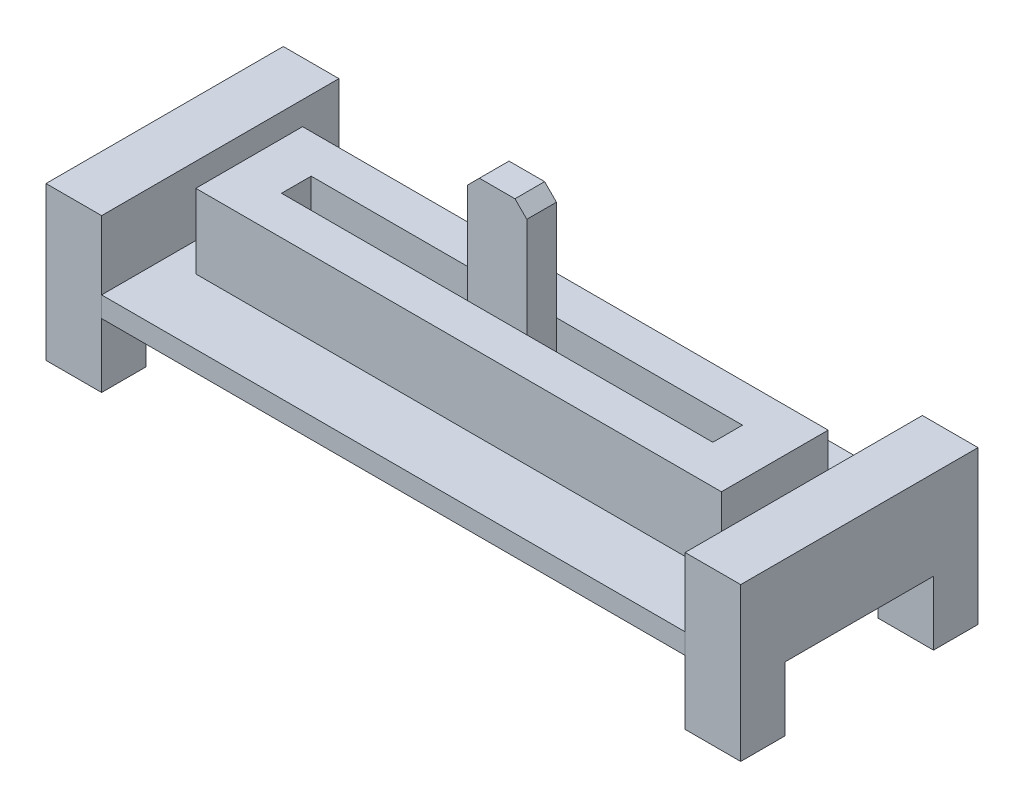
ISO-10303-21;
HEADER;
FILE_DESCRIPTION(('STEP AP214'),'2;1');
FILE_NAME('part.step','',(''),(''),'','','');
FILE_SCHEMA(('AUTOMOTIVE_DESIGN { 1 0 10303 214 1 1 1 1 }'));
ENDSEC;
DATA;
#1=APPLICATION_CONTEXT('core data for automotive mechanical design processes');
#2=APPLICATION_PROTOCOL_DEFINITION('international standard','automotive_design',2000,#1);
#3=PRODUCT_CONTEXT('',#1,'mechanical');
#4=PRODUCT('Part','Part','',(#3));
#5=PRODUCT_RELATED_PRODUCT_CATEGORY('part','',(#4));
#6=PRODUCT_DEFINITION_FORMATION('','',#4);
#7=PRODUCT_DEFINITION_CONTEXT('part definition',#1,'design');
#8=PRODUCT_DEFINITION('design','',#6,#7);
#9=PRODUCT_DEFINITION_SHAPE('','',#8);
#10=(LENGTH_UNIT() NAMED_UNIT(*) SI_UNIT(.MILLI.,.METRE.));
#11=(NAMED_UNIT(*) PLANE_ANGLE_UNIT() SI_UNIT($,.RADIAN.));
#12=(NAMED_UNIT(*) SI_UNIT($,.STERADIAN.) SOLID_ANGLE_UNIT());
#13=UNCERTAINTY_MEASURE_WITH_UNIT(LENGTH_MEASURE(1.E-05),#10,'distance_accuracy_value','');
#14=(GEOMETRIC_REPRESENTATION_CONTEXT(3) GLOBAL_UNCERTAINTY_ASSIGNED_CONTEXT((#13)) GLOBAL_UNIT_ASSIGNED_CONTEXT((#10,
#11,#12)) REPRESENTATION_CONTEXT('',''));
#15=CARTESIAN_POINT('',(0.,0.,0.));
#16=DIRECTION('',(0.,0.,1.));
#17=DIRECTION('',(1.,0.,0.));
#18=AXIS2_PLACEMENT_3D('',#15,#16,#17);
#19=CARTESIAN_POINT('',(29.7434,5.8801,-10.16));
#20=DIRECTION('',(0.,-1.,0.));
#21=DIRECTION('',(0.,0.,-1.));
#22=AXIS2_PLACEMENT_3D('',#19,#20,#21);
#23=PLANE('',#22);
#24=DIRECTION('',(0.,0.,1.));
#25=VECTOR('',#24,1.);
#26=CARTESIAN_POINT('',(24.9809,5.8801,-10.16));
#27=LINE('',#26,#25);
#28=CARTESIAN_POINT('',(24.9809,5.8801,-10.16));
#29=VERTEX_POINT('',#28);
#30=CARTESIAN_POINT('',(24.9809,5.8801,10.16));
#31=VERTEX_POINT('',#30);
#32=EDGE_CURVE('E139',#29,#31,#27,.T.);
#33=ORIENTED_EDGE('',*,*,#32,.T.);
#34=DIRECTION('',(-1.,0.,0.));
#35=VECTOR('',#34,1.);
#36=CARTESIAN_POINT('',(29.7434,5.8801,10.16));
#37=LINE('',#36,#35);
#38=CARTESIAN_POINT('',(29.7434,5.8801,10.16));
#39=VERTEX_POINT('',#38);
#40=EDGE_CURVE('E12',#39,#31,#37,.T.);
#41=ORIENTED_EDGE('',*,*,#40,.F.);
#42=DIRECTION('',(0.,0.,1.));
#43=VECTOR('',#42,1.);
#44=CARTESIAN_POINT('',(29.7434,5.8801,-10.16));
#45=LINE('',#44,#43);
#46=CARTESIAN_POINT('',(29.7434,5.8801,-10.16));
#47=VERTEX_POINT('',#46);
#48=EDGE_CURVE('E153',#47,#39,#45,.T.);
#49=ORIENTED_EDGE('',*,*,#48,.F.);
#50=DIRECTION('',(-1.,0.,0.));
#51=VECTOR('',#50,1.);
#52=CARTESIAN_POINT('',(29.7434,5.8801,-10.16));
#53=LINE('',#52,#51);
#54=EDGE_CURVE('E135',#47,#29,#53,.T.);
#55=ORIENTED_EDGE('',*,*,#54,.T.);
#56=EDGE_LOOP('',(#33,#41,#49,#55));
#57=FACE_BOUND('',#56,.T.);
#58=ADVANCED_FACE('F43',(#57),#23,.F.);
#59=CARTESIAN_POINT('',(29.7434,5.8801,10.16));
#60=DIRECTION('',(0.,0.,-1.));
#61=DIRECTION('',(0.,1.,0.));
#62=AXIS2_PLACEMENT_3D('',#59,#60,#61);
#63=PLANE('',#62);
#64=DIRECTION('',(0.,-1.,0.));
#65=VECTOR('',#64,1.);
#66=CARTESIAN_POINT('',(24.9809,5.8801,10.16));
#67=LINE('',#66,#65);
#68=CARTESIAN_POINT('',(24.9809,-7.239,10.16));
#69=VERTEX_POINT('',#68);
#70=EDGE_CURVE('E142',#31,#69,#67,.T.);
#71=ORIENTED_EDGE('',*,*,#70,.T.);
#72=DIRECTION('',(-1.,0.,0.));
#73=VECTOR('',#72,1.);
#74=CARTESIAN_POINT('',(29.7434,-7.239,10.16));
#75=LINE('',#74,#73);
#76=CARTESIAN_POINT('',(29.7434,-7.239,10.16));
#77=VERTEX_POINT('',#76);
#78=EDGE_CURVE('E51',#77,#69,#75,.T.);
#79=ORIENTED_EDGE('',*,*,#78,.F.);
#80=DIRECTION('',(0.,-1.,0.));
#81=VECTOR('',#80,1.);
#82=CARTESIAN_POINT('',(29.7434,5.8801,10.16));
#83=LINE('',#82,#81);
#84=EDGE_CURVE('E102',#39,#77,#83,.T.);
#85=ORIENTED_EDGE('',*,*,#84,.F.);
#86=ORIENTED_EDGE('',*,*,#40,.T.);
#87=EDGE_LOOP('',(#71,#79,#85,#86));
#88=FACE_BOUND('',#87,.T.);
#89=ADVANCED_FACE('F188',(#88),#63,.F.);
#90=CARTESIAN_POINT('',(29.7434,-7.239,10.16));
#91=DIRECTION('',(0.,1.,0.));
#92=DIRECTION('',(0.,0.,1.));
#93=AXIS2_PLACEMENT_3D('',#90,#91,#92);
#94=PLANE('',#93);
#95=DIRECTION('',(0.,0.,-1.));
#96=VECTOR('',#95,1.);
#97=CARTESIAN_POINT('',(24.9809,-7.239,10.16));
#98=LINE('',#97,#96);
#99=CARTESIAN_POINT('',(24.9809,-7.239,6.35));
#100=VERTEX_POINT('',#99);
#101=EDGE_CURVE('E144',#69,#100,#98,.T.);
#102=ORIENTED_EDGE('',*,*,#101,.T.);
#103=DIRECTION('',(-1.,0.,0.));
#104=VECTOR('',#103,1.);
#105=CARTESIAN_POINT('',(29.7434,-7.239,6.35));
#106=LINE('',#105,#104);
#107=CARTESIAN_POINT('',(29.7434,-7.239,6.35));
#108=VERTEX_POINT('',#107);
#109=EDGE_CURVE('E160',#108,#100,#106,.T.);
#110=ORIENTED_EDGE('',*,*,#109,.F.);
#111=DIRECTION('',(0.,0.,-1.));
#112=VECTOR('',#111,1.);
#113=CARTESIAN_POINT('',(29.7434,-7.239,10.16));
#114=LINE('',#113,#112);
#115=EDGE_CURVE('E168',#77,#108,#114,.T.);
#116=ORIENTED_EDGE('',*,*,#115,.F.);
#117=ORIENTED_EDGE('',*,*,#78,.T.);
#118=EDGE_LOOP('',(#102,#110,#116,#117));
#119=FACE_BOUND('',#118,.T.);
#120=ADVANCED_FACE('F166',(#119),#94,.F.);
#121=CARTESIAN_POINT('',(29.7434,-7.239,6.35));
#122=DIRECTION('',(0.,0.,1.));
#123=DIRECTION('',(0.,-1.,0.));
#124=AXIS2_PLACEMENT_3D('',#121,#122,#123);
#125=PLANE('',#124);
#126=DIRECTION('',(0.,1.,0.));
#127=VECTOR('',#126,1.);
#128=CARTESIAN_POINT('',(24.9809,-7.239,6.35));
#129=LINE('',#128,#127);
#130=CARTESIAN_POINT('',(24.9809,-1.7526,6.35));
#131=VERTEX_POINT('',#130);
#132=EDGE_CURVE('E146',#100,#131,#129,.T.);
#133=ORIENTED_EDGE('',*,*,#132,.T.);
#134=DIRECTION('',(-1.,0.,0.));
#135=VECTOR('',#134,1.);
#136=CARTESIAN_POINT('',(29.7434,-1.7526,6.35));
#137=LINE('',#136,#135);
#138=CARTESIAN_POINT('',(29.7434,-1.7526,6.35));
#139=VERTEX_POINT('',#138);
#140=EDGE_CURVE('E157',#139,#131,#137,.T.);
#141=ORIENTED_EDGE('',*,*,#140,.F.);
#142=DIRECTION('',(0.,1.,0.));
#143=VECTOR('',#142,1.);
#144=CARTESIAN_POINT('',(29.7434,-7.239,6.35));
#145=LINE('',#144,#143);
#146=EDGE_CURVE('E180',#108,#139,#145,.T.);
#147=ORIENTED_EDGE('',*,*,#146,.F.);
#148=ORIENTED_EDGE('',*,*,#109,.T.);
#149=EDGE_LOOP('',(#133,#141,#147,#148));
#150=FACE_BOUND('',#149,.T.);
#151=ADVANCED_FACE('F176',(#150),#125,.F.);
#152=CARTESIAN_POINT('',(29.7434,-1.7526,6.35));
#153=DIRECTION('',(0.,1.,0.));
#154=DIRECTION('',(0.,0.,1.));
#155=AXIS2_PLACEMENT_3D('',#152,#153,#154);
#156=PLANE('',#155);
#157=DIRECTION('',(0.,0.,-1.));
#158=VECTOR('',#157,1.);
#159=CARTESIAN_POINT('',(24.9809,-1.7526,6.35));
#160=LINE('',#159,#158);
#161=CARTESIAN_POINT('',(24.9809,-1.7526,-6.35));
#162=VERTEX_POINT('',#161);
#163=EDGE_CURVE('E148',#131,#162,#160,.T.);
#164=ORIENTED_EDGE('',*,*,#163,.T.);
#165=DIRECTION('',(-1.,0.,0.));
#166=VECTOR('',#165,1.);
#167=CARTESIAN_POINT('',(29.7434,-1.7526,-6.35));
#168=LINE('',#167,#166);
#169=CARTESIAN_POINT('',(29.7434,-1.7526,-6.35));
#170=VERTEX_POINT('',#169);
#171=EDGE_CURVE('E130',#170,#162,#168,.T.);
#172=ORIENTED_EDGE('',*,*,#171,.F.);
#173=DIRECTION('',(0.,0.,-1.));
#174=VECTOR('',#173,1.);
#175=CARTESIAN_POINT('',(29.7434,-1.7526,6.35));
#176=LINE('',#175,#174);
#177=EDGE_CURVE('E121',#139,#170,#176,.T.);
#178=ORIENTED_EDGE('',*,*,#177,.F.);
#179=ORIENTED_EDGE('',*,*,#140,.T.);
#180=EDGE_LOOP('',(#164,#172,#178,#179));
#181=FACE_BOUND('',#180,.T.);
#182=ADVANCED_FACE('F179',(#181),#156,.F.);
#183=CARTESIAN_POINT('',(29.7434,-1.7526,-6.35));
#184=DIRECTION('',(0.,0.,-1.));
#185=DIRECTION('',(-1.,0.,0.));
#186=AXIS2_PLACEMENT_3D('',#183,#184,#185);
#187=PLANE('',#186);
#188=DIRECTION('',(0.,-1.,0.));
#189=VECTOR('',#188,1.);
#190=CARTESIAN_POINT('',(24.9809,-1.7526,-6.35));
#191=LINE('',#190,#189);
#192=CARTESIAN_POINT('',(24.9809,-7.239,-6.35));
#193=VERTEX_POINT('',#192);
#194=EDGE_CURVE('E129',#162,#193,#191,.T.);
#195=ORIENTED_EDGE('',*,*,#194,.T.);
#196=DIRECTION('',(-1.,0.,0.));
#197=VECTOR('',#196,1.);
#198=CARTESIAN_POINT('',(29.7434,-7.239,-6.35));
#199=LINE('',#198,#197);
#200=CARTESIAN_POINT('',(29.7434,-7.239,-6.35));
#201=VERTEX_POINT('',#200);
#202=EDGE_CURVE('E126',#201,#193,#199,.T.);
#203=ORIENTED_EDGE('',*,*,#202,.F.);
#204=DIRECTION('',(0.,-1.,0.));
#205=VECTOR('',#204,1.);
#206=CARTESIAN_POINT('',(29.7434,-1.7526,-6.35));
#207=LINE('',#206,#205);
#208=EDGE_CURVE('E115',#170,#201,#207,.T.);
#209=ORIENTED_EDGE('',*,*,#208,.F.);
#210=ORIENTED_EDGE('',*,*,#171,.T.);
#211=EDGE_LOOP('',(#195,#203,#209,#210));
#212=FACE_BOUND('',#211,.T.);
#213=ADVANCED_FACE('F127',(#212),#187,.F.);
#214=CARTESIAN_POINT('',(29.7434,-7.239,-6.35));
#215=DIRECTION('',(0.,1.,0.));
#216=DIRECTION('',(0.,0.,1.));
#217=AXIS2_PLACEMENT_3D('',#214,#215,#216);
#218=PLANE('',#217);
#219=DIRECTION('',(0.,0.,-1.));
#220=VECTOR('',#219,1.);
#221=CARTESIAN_POINT('',(24.9809,-7.239,-6.35));
#222=LINE('',#221,#220);
#223=CARTESIAN_POINT('',(24.9809,-7.239,-10.16));
#224=VERTEX_POINT('',#223);
#225=EDGE_CURVE('E88',#193,#224,#222,.T.);
#226=ORIENTED_EDGE('',*,*,#225,.T.);
#227=DIRECTION('',(-1.,0.,0.));
#228=VECTOR('',#227,1.);
#229=CARTESIAN_POINT('',(29.7434,-7.239,-10.16));
#230=LINE('',#229,#228);
#231=CARTESIAN_POINT('',(29.7434,-7.239,-10.16));
#232=VERTEX_POINT('',#231);
#233=EDGE_CURVE('E131',#232,#224,#230,.T.);
#234=ORIENTED_EDGE('',*,*,#233,.F.);
#235=DIRECTION('',(0.,0.,-1.));
#236=VECTOR('',#235,1.);
#237=CARTESIAN_POINT('',(29.7434,-7.239,-6.35));
#238=LINE('',#237,#236);
#239=EDGE_CURVE('E119',#201,#232,#238,.T.);
#240=ORIENTED_EDGE('',*,*,#239,.F.);
#241=ORIENTED_EDGE('',*,*,#202,.T.);
#242=EDGE_LOOP('',(#226,#234,#240,#241));
#243=FACE_BOUND('',#242,.T.);
#244=ADVANCED_FACE('F133',(#243),#218,.F.);
#245=CARTESIAN_POINT('',(29.7434,-7.239,-10.16));
#246=DIRECTION('',(0.,0.,1.));
#247=DIRECTION('',(0.,-1.,0.));
#248=AXIS2_PLACEMENT_3D('',#245,#246,#247);
#249=PLANE('',#248);
#250=DIRECTION('',(0.,1.,0.));
#251=VECTOR('',#250,1.);
#252=CARTESIAN_POINT('',(24.9809,-7.239,-10.16));
#253=LINE('',#252,#251);
#254=EDGE_CURVE('E94',#224,#29,#253,.T.);
#255=ORIENTED_EDGE('',*,*,#254,.T.);
#256=ORIENTED_EDGE('',*,*,#54,.F.);
#257=DIRECTION('',(0.,1.,0.));
#258=VECTOR('',#257,1.);
#259=CARTESIAN_POINT('',(29.7434,-7.239,-10.16));
#260=LINE('',#259,#258);
#261=EDGE_CURVE('E59',#232,#47,#260,.T.);
#262=ORIENTED_EDGE('',*,*,#261,.F.);
#263=ORIENTED_EDGE('',*,*,#233,.T.);
#264=EDGE_LOOP('',(#255,#256,#262,#263));
#265=FACE_BOUND('',#264,.T.);
#266=ADVANCED_FACE('F204',(#265),#249,.F.);
#267=CARTESIAN_POINT('',(29.7434,0.,0.));
#268=DIRECTION('',(1.,0.,0.));
#269=DIRECTION('',(0.,0.,-1.));
#270=AXIS2_PLACEMENT_3D('',#267,#268,#269);
#271=PLANE('',#270);
#272=ORIENTED_EDGE('',*,*,#48,.T.);
#273=ORIENTED_EDGE('',*,*,#84,.T.);
#274=ORIENTED_EDGE('',*,*,#115,.T.);
#275=ORIENTED_EDGE('',*,*,#146,.T.);
#276=ORIENTED_EDGE('',*,*,#177,.T.);
#277=ORIENTED_EDGE('',*,*,#208,.T.);
#278=ORIENTED_EDGE('',*,*,#239,.T.);
#279=ORIENTED_EDGE('',*,*,#261,.T.);
#280=EDGE_LOOP('',(#272,#273,#274,#275,#276,#277,#278,#279));
#281=FACE_BOUND('',#280,.T.);
#282=ADVANCED_FACE('F117',(#281),#271,.T.);
#283=CARTESIAN_POINT('',(24.9809,0.,0.));
#284=DIRECTION('',(1.,0.,0.));
#285=DIRECTION('',(0.,0.,-1.));
#286=AXIS2_PLACEMENT_3D('',#283,#284,#285);
#287=PLANE('',#286);
#288=ORIENTED_EDGE('',*,*,#32,.F.);
#289=ORIENTED_EDGE('',*,*,#254,.F.);
#290=ORIENTED_EDGE('',*,*,#225,.F.);
#291=ORIENTED_EDGE('',*,*,#194,.F.);
#292=ORIENTED_EDGE('',*,*,#163,.F.);
#293=ORIENTED_EDGE('',*,*,#132,.F.);
#294=ORIENTED_EDGE('',*,*,#101,.F.);
#295=ORIENTED_EDGE('',*,*,#70,.F.);
#296=EDGE_LOOP('',(#288,#289,#290,#291,#292,#293,#294,#295));
#297=FACE_BOUND('',#296,.T.);
#298=ADVANCED_FACE('F172',(#297),#287,.F.);
#299=CLOSED_SHELL('',(#58,#89,#120,#151,#182,#213,#244,#266,#282,#298));
#300=MANIFOLD_SOLID_BREP('B2',#299);
#301=CARTESIAN_POINT('',(-29.7434,5.8801,-10.16));
#302=DIRECTION('',(0.,0.,1.));
#303=DIRECTION('',(0.,-1.,0.));
#304=AXIS2_PLACEMENT_3D('',#301,#302,#303);
#305=PLANE('',#304);
#306=DIRECTION('',(0.,-1.,0.));
#307=VECTOR('',#306,1.);
#308=CARTESIAN_POINT('',(-24.9809,5.8801,-10.16));
#309=LINE('',#308,#307);
#310=CARTESIAN_POINT('',(-24.9809,5.8801,-10.16));
#311=VERTEX_POINT('',#310);
#312=CARTESIAN_POINT('',(-24.9809,-7.239,-10.16));
#313=VERTEX_POINT('',#312);
#314=EDGE_CURVE('E375',#311,#313,#309,.T.);
#315=ORIENTED_EDGE('',*,*,#314,.T.);
#316=DIRECTION('',(1.,0.,0.));
#317=VECTOR('',#316,1.);
#318=CARTESIAN_POINT('',(-29.7434,-7.239,-10.16));
#319=LINE('',#318,#317);
#320=CARTESIAN_POINT('',(-29.7434,-7.239,-10.16));
#321=VERTEX_POINT('',#320);
#322=EDGE_CURVE('E41',#321,#313,#319,.T.);
#323=ORIENTED_EDGE('',*,*,#322,.F.);
#324=DIRECTION('',(0.,-1.,0.));
#325=VECTOR('',#324,1.);
#326=CARTESIAN_POINT('',(-29.7434,5.8801,-10.16));
#327=LINE('',#326,#325);
#328=CARTESIAN_POINT('',(-29.7434,5.8801,-10.16));
#329=VERTEX_POINT('',#328);
#330=EDGE_CURVE('E390',#329,#321,#327,.T.);
#331=ORIENTED_EDGE('',*,*,#330,.F.);
#332=DIRECTION('',(1.,0.,0.));
#333=VECTOR('',#332,1.);
#334=CARTESIAN_POINT('',(-29.7434,5.8801,-10.16));
#335=LINE('',#334,#333);
#336=EDGE_CURVE('E371',#329,#311,#335,.T.);
#337=ORIENTED_EDGE('',*,*,#336,.T.);
#338=EDGE_LOOP('',(#315,#323,#331,#337));
#339=FACE_BOUND('',#338,.T.);
#340=ADVANCED_FACE('F279',(#339),#305,.F.);
#341=CARTESIAN_POINT('',(-29.7434,-7.239,-10.16));
#342=DIRECTION('',(0.,1.,0.));
#343=DIRECTION('',(0.,0.,1.));
#344=AXIS2_PLACEMENT_3D('',#341,#342,#343);
#345=PLANE('',#344);
#346=DIRECTION('',(0.,0.,1.));
#347=VECTOR('',#346,1.);
#348=CARTESIAN_POINT('',(-24.9809,-7.239,-10.16));
#349=LINE('',#348,#347);
#350=CARTESIAN_POINT('',(-24.9809,-7.239,-6.35));
#351=VERTEX_POINT('',#350);
#352=EDGE_CURVE('E378',#313,#351,#349,.T.);
#353=ORIENTED_EDGE('',*,*,#352,.T.);
#354=DIRECTION('',(1.,0.,0.));
#355=VECTOR('',#354,1.);
#356=CARTESIAN_POINT('',(-29.7434,-7.239,-6.35));
#357=LINE('',#356,#355);
#358=CARTESIAN_POINT('',(-29.7434,-7.239,-6.35));
#359=VERTEX_POINT('',#358);
#360=EDGE_CURVE('E287',#359,#351,#357,.T.);
#361=ORIENTED_EDGE('',*,*,#360,.F.);
#362=DIRECTION('',(0.,0.,1.));
#363=VECTOR('',#362,1.);
#364=CARTESIAN_POINT('',(-29.7434,-7.239,-10.16));
#365=LINE('',#364,#363);
#366=EDGE_CURVE('E338',#321,#359,#365,.T.);
#367=ORIENTED_EDGE('',*,*,#366,.F.);
#368=ORIENTED_EDGE('',*,*,#322,.T.);
#369=EDGE_LOOP('',(#353,#361,#367,#368));
#370=FACE_BOUND('',#369,.T.);
#371=ADVANCED_FACE('F424',(#370),#345,.F.);
#372=CARTESIAN_POINT('',(-29.7434,-1.7526,-6.35));
#373=DIRECTION('',(0.,0.,-1.));
#374=DIRECTION('',(-1.,0.,0.));
#375=AXIS2_PLACEMENT_3D('',#372,#373,#374);
#376=PLANE('',#375);
#377=DIRECTION('',(0.,1.,0.));
#378=VECTOR('',#377,1.);
#379=CARTESIAN_POINT('',(-24.9809,-1.7526,-6.35));
#380=LINE('',#379,#378);
#381=CARTESIAN_POINT('',(-24.9809,-1.7526,-6.35));
#382=VERTEX_POINT('',#381);
#383=EDGE_CURVE('E380',#351,#382,#380,.T.);
#384=ORIENTED_EDGE('',*,*,#383,.T.);
#385=DIRECTION('',(1.,0.,0.));
#386=VECTOR('',#385,1.);
#387=CARTESIAN_POINT('',(-29.7434,-1.7526,-6.35));
#388=LINE('',#387,#386);
#389=CARTESIAN_POINT('',(-29.7434,-1.7526,-6.35));
#390=VERTEX_POINT('',#389);
#391=EDGE_CURVE('E397',#390,#382,#388,.T.);
#392=ORIENTED_EDGE('',*,*,#391,.F.);
#393=DIRECTION('',(0.,1.,0.));
#394=VECTOR('',#393,1.);
#395=CARTESIAN_POINT('',(-29.7434,-1.7526,-6.35));
#396=LINE('',#395,#394);
#397=EDGE_CURVE('E405',#359,#390,#396,.T.);
#398=ORIENTED_EDGE('',*,*,#397,.F.);
#399=ORIENTED_EDGE('',*,*,#360,.T.);
#400=EDGE_LOOP('',(#384,#392,#398,#399));
#401=FACE_BOUND('',#400,.T.);
#402=ADVANCED_FACE('F403',(#401),#376,.F.);
#403=CARTESIAN_POINT('',(-29.7434,-1.7526,0.));
#404=DIRECTION('',(0.,1.,0.));
#405=DIRECTION('',(0.,0.,1.));
#406=AXIS2_PLACEMENT_3D('',#403,#404,#405);
#407=PLANE('',#406);
#408=DIRECTION('',(0.,0.,1.));
#409=VECTOR('',#408,1.);
#410=CARTESIAN_POINT('',(-24.9809,-1.7526,0.));
#411=LINE('',#410,#409);
#412=CARTESIAN_POINT('',(-24.9809,-1.7526,6.35));
#413=VERTEX_POINT('',#412);
#414=EDGE_CURVE('E383',#382,#413,#411,.T.);
#415=ORIENTED_EDGE('',*,*,#414,.T.);
#416=DIRECTION('',(1.,0.,0.));
#417=VECTOR('',#416,1.);
#418=CARTESIAN_POINT('',(-29.7434,-1.7526,6.35));
#419=LINE('',#418,#417);
#420=CARTESIAN_POINT('',(-29.7434,-1.7526,6.35));
#421=VERTEX_POINT('',#420);
#422=EDGE_CURVE('E394',#421,#413,#419,.T.);
#423=ORIENTED_EDGE('',*,*,#422,.F.);
#424=DIRECTION('',(0.,0.,1.));
#425=VECTOR('',#424,1.);
#426=CARTESIAN_POINT('',(-29.7434,-1.7526,-6.35));
#427=LINE('',#426,#425);
#428=EDGE_CURVE('E416',#390,#421,#427,.T.);
#429=ORIENTED_EDGE('',*,*,#428,.F.);
#430=ORIENTED_EDGE('',*,*,#391,.T.);
#431=EDGE_LOOP('',(#415,#423,#429,#430));
#432=FACE_BOUND('',#431,.T.);
#433=ADVANCED_FACE('F412',(#432),#407,.F.);
#434=CARTESIAN_POINT('',(-29.7434,-1.7526,6.35));
#435=DIRECTION('',(0.,0.,1.));
#436=DIRECTION('',(0.,-1.,0.));
#437=AXIS2_PLACEMENT_3D('',#434,#435,#436);
#438=PLANE('',#437);
#439=DIRECTION('',(0.,-1.,0.));
#440=VECTOR('',#439,1.);
#441=CARTESIAN_POINT('',(-24.9809,-1.7526,6.35));
#442=LINE('',#441,#440);
#443=CARTESIAN_POINT('',(-24.9809,-7.239,6.35));
#444=VERTEX_POINT('',#443);
#445=EDGE_CURVE('E385',#413,#444,#442,.T.);
#446=ORIENTED_EDGE('',*,*,#445,.T.);
#447=DIRECTION('',(1.,0.,0.));
#448=VECTOR('',#447,1.);
#449=CARTESIAN_POINT('',(-29.7434,-7.239,6.35));
#450=LINE('',#449,#448);
#451=CARTESIAN_POINT('',(-29.7434,-7.239,6.35));
#452=VERTEX_POINT('',#451);
#453=EDGE_CURVE('E366',#452,#444,#450,.T.);
#454=ORIENTED_EDGE('',*,*,#453,.F.);
#455=DIRECTION('',(0.,-1.,0.));
#456=VECTOR('',#455,1.);
#457=CARTESIAN_POINT('',(-29.7434,-1.7526,6.35));
#458=LINE('',#457,#456);
#459=EDGE_CURVE('E357',#421,#452,#458,.T.);
#460=ORIENTED_EDGE('',*,*,#459,.F.);
#461=ORIENTED_EDGE('',*,*,#422,.T.);
#462=EDGE_LOOP('',(#446,#454,#460,#461));
#463=FACE_BOUND('',#462,.T.);
#464=ADVANCED_FACE('F415',(#463),#438,.F.);
#465=CARTESIAN_POINT('',(-29.7434,-7.239,6.35));
#466=DIRECTION('',(0.,1.,0.));
#467=DIRECTION('',(0.,0.,1.));
#468=AXIS2_PLACEMENT_3D('',#465,#466,#467);
#469=PLANE('',#468);
#470=DIRECTION('',(0.,0.,1.));
#471=VECTOR('',#470,1.);
#472=CARTESIAN_POINT('',(-24.9809,-7.239,6.35));
#473=LINE('',#472,#471);
#474=CARTESIAN_POINT('',(-24.9809,-7.239,10.16));
#475=VERTEX_POINT('',#474);
#476=EDGE_CURVE('E365',#444,#475,#473,.T.);
#477=ORIENTED_EDGE('',*,*,#476,.T.);
#478=DIRECTION('',(1.,0.,0.));
#479=VECTOR('',#478,1.);
#480=CARTESIAN_POINT('',(-29.7434,-7.239,10.16));
#481=LINE('',#480,#479);
#482=CARTESIAN_POINT('',(-29.7434,-7.239,10.16));
#483=VERTEX_POINT('',#482);
#484=EDGE_CURVE('E362',#483,#475,#481,.T.);
#485=ORIENTED_EDGE('',*,*,#484,.F.);
#486=DIRECTION('',(0.,0.,1.));
#487=VECTOR('',#486,1.);
#488=CARTESIAN_POINT('',(-29.7434,-7.239,6.35));
#489=LINE('',#488,#487);
#490=EDGE_CURVE('E351',#452,#483,#489,.T.);
#491=ORIENTED_EDGE('',*,*,#490,.F.);
#492=ORIENTED_EDGE('',*,*,#453,.T.);
#493=EDGE_LOOP('',(#477,#485,#491,#492));
#494=FACE_BOUND('',#493,.T.);
#495=ADVANCED_FACE('F363',(#494),#469,.F.);
#496=CARTESIAN_POINT('',(-29.7434,5.8801,10.16));
#497=DIRECTION('',(0.,0.,-1.));
#498=DIRECTION('',(0.,1.,0.));
#499=AXIS2_PLACEMENT_3D('',#496,#497,#498);
#500=PLANE('',#499);
#501=DIRECTION('',(0.,1.,0.));
#502=VECTOR('',#501,1.);
#503=CARTESIAN_POINT('',(-24.9809,5.8801,10.16));
#504=LINE('',#503,#502);
#505=CARTESIAN_POINT('',(-24.9809,5.8801,10.16));
#506=VERTEX_POINT('',#505);
#507=EDGE_CURVE('E324',#475,#506,#504,.T.);
#508=ORIENTED_EDGE('',*,*,#507,.T.);
#509=DIRECTION('',(1.,0.,0.));
#510=VECTOR('',#509,1.);
#511=CARTESIAN_POINT('',(-29.7434,5.8801,10.16));
#512=LINE('',#511,#510);
#513=CARTESIAN_POINT('',(-29.7434,5.8801,10.16));
#514=VERTEX_POINT('',#513);
#515=EDGE_CURVE('E367',#514,#506,#512,.T.);
#516=ORIENTED_EDGE('',*,*,#515,.F.);
#517=DIRECTION('',(0.,1.,0.));
#518=VECTOR('',#517,1.);
#519=CARTESIAN_POINT('',(-29.7434,5.8801,10.16));
#520=LINE('',#519,#518);
#521=EDGE_CURVE('E355',#483,#514,#520,.T.);
#522=ORIENTED_EDGE('',*,*,#521,.F.);
#523=ORIENTED_EDGE('',*,*,#484,.T.);
#524=EDGE_LOOP('',(#508,#516,#522,#523));
#525=FACE_BOUND('',#524,.T.);
#526=ADVANCED_FACE('F369',(#525),#500,.F.);
#527=CARTESIAN_POINT('',(-29.7434,5.8801,-10.16));
#528=DIRECTION('',(0.,-1.,0.));
#529=DIRECTION('',(0.,0.,-1.));
#530=AXIS2_PLACEMENT_3D('',#527,#528,#529);
#531=PLANE('',#530);
#532=DIRECTION('',(0.,0.,-1.));
#533=VECTOR('',#532,1.);
#534=CARTESIAN_POINT('',(-24.9809,5.8801,-10.16));
#535=LINE('',#534,#533);
#536=EDGE_CURVE('E330',#506,#311,#535,.T.);
#537=ORIENTED_EDGE('',*,*,#536,.T.);
#538=ORIENTED_EDGE('',*,*,#336,.F.);
#539=DIRECTION('',(0.,0.,-1.));
#540=VECTOR('',#539,1.);
#541=CARTESIAN_POINT('',(-29.7434,5.8801,-10.16));
#542=LINE('',#541,#540);
#543=EDGE_CURVE('E295',#514,#329,#542,.T.);
#544=ORIENTED_EDGE('',*,*,#543,.F.);
#545=ORIENTED_EDGE('',*,*,#515,.T.);
#546=EDGE_LOOP('',(#537,#538,#544,#545));
#547=FACE_BOUND('',#546,.T.);
#548=ADVANCED_FACE('F440',(#547),#531,.F.);
#549=CARTESIAN_POINT('',(-29.7434,0.,0.));
#550=DIRECTION('',(-1.,0.,0.));
#551=DIRECTION('',(0.,0.,1.));
#552=AXIS2_PLACEMENT_3D('',#549,#550,#551);
#553=PLANE('',#552);
#554=ORIENTED_EDGE('',*,*,#330,.T.);
#555=ORIENTED_EDGE('',*,*,#366,.T.);
#556=ORIENTED_EDGE('',*,*,#397,.T.);
#557=ORIENTED_EDGE('',*,*,#428,.T.);
#558=ORIENTED_EDGE('',*,*,#459,.T.);
#559=ORIENTED_EDGE('',*,*,#490,.T.);
#560=ORIENTED_EDGE('',*,*,#521,.T.);
#561=ORIENTED_EDGE('',*,*,#543,.T.);
#562=EDGE_LOOP('',(#554,#555,#556,#557,#558,#559,#560,#561));
#563=FACE_BOUND('',#562,.T.);
#564=ADVANCED_FACE('F353',(#563),#553,.T.);
#565=CARTESIAN_POINT('',(-24.9809,0.,0.));
#566=DIRECTION('',(-1.,0.,0.));
#567=DIRECTION('',(0.,0.,1.));
#568=AXIS2_PLACEMENT_3D('',#565,#566,#567);
#569=PLANE('',#568);
#570=ORIENTED_EDGE('',*,*,#314,.F.);
#571=ORIENTED_EDGE('',*,*,#536,.F.);
#572=ORIENTED_EDGE('',*,*,#507,.F.);
#573=ORIENTED_EDGE('',*,*,#476,.F.);
#574=ORIENTED_EDGE('',*,*,#445,.F.);
#575=ORIENTED_EDGE('',*,*,#414,.F.);
#576=ORIENTED_EDGE('',*,*,#383,.F.);
#577=ORIENTED_EDGE('',*,*,#352,.F.);
#578=EDGE_LOOP('',(#570,#571,#572,#573,#574,#575,#576,#577));
#579=FACE_BOUND('',#578,.T.);
#580=ADVANCED_FACE('F408',(#579),#569,.F.);
#581=CLOSED_SHELL('',(#340,#371,#402,#433,#464,#495,#526,#548,#564,#580));
#582=MANIFOLD_SOLID_BREP('B6',#581);
#583=CARTESIAN_POINT('',(18.4658,3.175,-1.27));
#584=DIRECTION('',(0.,0.,-1.));
#585=DIRECTION('',(-1.,0.,0.));
#586=AXIS2_PLACEMENT_3D('',#583,#584,#585);
#587=PLANE('',#586);
#588=DIRECTION('',(0.,-1.,0.));
#589=VECTOR('',#588,1.);
#590=CARTESIAN_POINT('',(-2.54,15.9385,-1.27));
#591=LINE('',#590,#589);
#592=CARTESIAN_POINT('',(-2.54,6.35,-1.27));
#593=VERTEX_POINT('',#592);
#594=CARTESIAN_POINT('',(-2.54,3.175,-1.27));
#595=VERTEX_POINT('',#594);
#596=EDGE_CURVE('E673',#593,#595,#591,.T.);
#597=ORIENTED_EDGE('',*,*,#596,.F.);
#598=DIRECTION('',(-1.,0.,0.));
#599=VECTOR('',#598,1.);
#600=CARTESIAN_POINT('',(18.4658,6.35,-1.27));
#601=LINE('',#600,#599);
#602=CARTESIAN_POINT('',(-18.4658,6.35,-1.27));
#603=VERTEX_POINT('',#602);
#604=EDGE_CURVE('E731',#593,#603,#601,.T.);
#605=ORIENTED_EDGE('',*,*,#604,.T.);
#606=DIRECTION('',(0.,1.,0.));
#607=VECTOR('',#606,1.);
#608=CARTESIAN_POINT('',(-18.4658,3.175,-1.27));
#609=LINE('',#608,#607);
#610=CARTESIAN_POINT('',(-18.4658,3.175,-1.27));
#611=VERTEX_POINT('',#610);
#612=EDGE_CURVE('E734',#611,#603,#609,.T.);
#613=ORIENTED_EDGE('',*,*,#612,.F.);
#614=DIRECTION('',(-1.,0.,0.));
#615=VECTOR('',#614,1.);
#616=CARTESIAN_POINT('',(18.4658,3.175,-1.27));
#617=LINE('',#616,#615);
#618=EDGE_CURVE('E718',#595,#611,#617,.T.);
#619=ORIENTED_EDGE('',*,*,#618,.F.);
#620=EDGE_LOOP('',(#597,#605,#613,#619));
#621=FACE_BOUND('',#620,.T.);
#622=ADVANCED_FACE('F509',(#621),#587,.F.);
#623=DIRECTION('',(0.,1.,0.));
#624=VECTOR('',#623,1.);
#625=CARTESIAN_POINT('',(2.54,15.9385,-1.27));
#626=LINE('',#625,#624);
#627=CARTESIAN_POINT('',(2.54,3.175,-1.27));
#628=VERTEX_POINT('',#627);
#629=CARTESIAN_POINT('',(2.54,6.35,-1.27));
#630=VERTEX_POINT('',#629);
#631=EDGE_CURVE('E684',#628,#630,#626,.T.);
#632=ORIENTED_EDGE('',*,*,#631,.F.);
#633=CARTESIAN_POINT('',(18.4658,3.175,-1.27));
#634=VERTEX_POINT('',#633);
#635=EDGE_CURVE('E719',#634,#628,#617,.T.);
#636=ORIENTED_EDGE('',*,*,#635,.F.);
#637=DIRECTION('',(0.,1.,0.));
#638=VECTOR('',#637,1.);
#639=CARTESIAN_POINT('',(18.4658,3.175,-1.27));
#640=LINE('',#639,#638);
#641=CARTESIAN_POINT('',(18.4658,6.35,-1.27));
#642=VERTEX_POINT('',#641);
#643=EDGE_CURVE('E738',#634,#642,#640,.T.);
#644=ORIENTED_EDGE('',*,*,#643,.T.);
#645=EDGE_CURVE('E711',#642,#630,#601,.T.);
#646=ORIENTED_EDGE('',*,*,#645,.T.);
#647=EDGE_LOOP('',(#632,#636,#644,#646));
#648=FACE_BOUND('',#647,.T.);
#649=ADVANCED_FACE('F823',(#648),#587,.F.);
#650=CARTESIAN_POINT('',(18.4658,3.175,1.27));
#651=DIRECTION('',(0.,0.,1.));
#652=DIRECTION('',(1.,0.,0.));
#653=AXIS2_PLACEMENT_3D('',#650,#651,#652);
#654=PLANE('',#653);
#655=DIRECTION('',(0.,-1.,0.));
#656=VECTOR('',#655,1.);
#657=CARTESIAN_POINT('',(-2.54,15.9385,1.27));
#658=LINE('',#657,#656);
#659=CARTESIAN_POINT('',(-2.54,6.35,1.27));
#660=VERTEX_POINT('',#659);
#661=CARTESIAN_POINT('',(-2.54,3.175,1.27));
#662=VERTEX_POINT('',#661);
#663=EDGE_CURVE('E696',#660,#662,#658,.T.);
#664=ORIENTED_EDGE('',*,*,#663,.T.);
#665=DIRECTION('',(1.,0.,0.));
#666=VECTOR('',#665,1.);
#667=CARTESIAN_POINT('',(18.4658,3.175,1.27));
#668=LINE('',#667,#666);
#669=CARTESIAN_POINT('',(-18.4658,3.175,1.27));
#670=VERTEX_POINT('',#669);
#671=EDGE_CURVE('E712',#670,#662,#668,.T.);
#672=ORIENTED_EDGE('',*,*,#671,.F.);
#673=DIRECTION('',(0.,1.,0.));
#674=VECTOR('',#673,1.);
#675=CARTESIAN_POINT('',(-18.4658,3.175,1.27));
#676=LINE('',#675,#674);
#677=CARTESIAN_POINT('',(-18.4658,6.35,1.27));
#678=VERTEX_POINT('',#677);
#679=EDGE_CURVE('E722',#670,#678,#676,.T.);
#680=ORIENTED_EDGE('',*,*,#679,.T.);
#681=DIRECTION('',(1.,0.,0.));
#682=VECTOR('',#681,1.);
#683=CARTESIAN_POINT('',(18.4658,6.35,1.27));
#684=LINE('',#683,#682);
#685=EDGE_CURVE('E725',#678,#660,#684,.T.);
#686=ORIENTED_EDGE('',*,*,#685,.T.);
#687=EDGE_LOOP('',(#664,#672,#680,#686));
#688=FACE_BOUND('',#687,.T.);
#689=ADVANCED_FACE('F854',(#688),#654,.F.);
#690=DIRECTION('',(0.,1.,0.));
#691=VECTOR('',#690,1.);
#692=CARTESIAN_POINT('',(2.54,15.9385,1.27));
#693=LINE('',#692,#691);
#694=CARTESIAN_POINT('',(2.54,3.175,1.27));
#695=VERTEX_POINT('',#694);
#696=CARTESIAN_POINT('',(2.54,6.35,1.27));
#697=VERTEX_POINT('',#696);
#698=EDGE_CURVE('E689',#695,#697,#693,.T.);
#699=ORIENTED_EDGE('',*,*,#698,.T.);
#700=CARTESIAN_POINT('',(18.4658,6.35,1.27));
#701=VERTEX_POINT('',#700);
#702=EDGE_CURVE('E724',#697,#701,#684,.T.);
#703=ORIENTED_EDGE('',*,*,#702,.T.);
#704=DIRECTION('',(0.,1.,0.));
#705=VECTOR('',#704,1.);
#706=CARTESIAN_POINT('',(18.4658,3.175,1.27));
#707=LINE('',#706,#705);
#708=CARTESIAN_POINT('',(18.4658,3.175,1.27));
#709=VERTEX_POINT('',#708);
#710=EDGE_CURVE('E740',#709,#701,#707,.T.);
#711=ORIENTED_EDGE('',*,*,#710,.F.);
#712=EDGE_CURVE('E710',#695,#709,#668,.T.);
#713=ORIENTED_EDGE('',*,*,#712,.F.);
#714=EDGE_LOOP('',(#699,#703,#711,#713));
#715=FACE_BOUND('',#714,.T.);
#716=ADVANCED_FACE('F831',(#715),#654,.F.);
#717=CARTESIAN_POINT('',(0.,3.175,0.));
#718=DIRECTION('',(0.,1.,0.));
#719=DIRECTION('',(0.,0.,1.));
#720=AXIS2_PLACEMENT_3D('',#717,#718,#719);
#721=PLANE('',#720);
#722=ORIENTED_EDGE('',*,*,#671,.T.);
#723=DIRECTION('',(0.,0.,-1.));
#724=VECTOR('',#723,1.);
#725=CARTESIAN_POINT('',(-2.54,3.175,15.0072971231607));
#726=LINE('',#725,#724);
#727=EDGE_CURVE('E688',#662,#595,#726,.T.);
#728=ORIENTED_EDGE('',*,*,#727,.T.);
#729=ORIENTED_EDGE('',*,*,#618,.T.);
#730=DIRECTION('',(0.,0.,1.));
#731=VECTOR('',#730,1.);
#732=CARTESIAN_POINT('',(-18.4658,3.175,1.27));
#733=LINE('',#732,#731);
#734=EDGE_CURVE('E707',#611,#670,#733,.T.);
#735=ORIENTED_EDGE('',*,*,#734,.T.);
#736=EDGE_LOOP('',(#722,#728,#729,#735));
#737=FACE_BOUND('',#736,.T.);
#738=ADVANCED_FACE('F837',(#737),#721,.T.);
#739=ORIENTED_EDGE('',*,*,#635,.T.);
#740=DIRECTION('',(0.,0.,-1.));
#741=VECTOR('',#740,1.);
#742=CARTESIAN_POINT('',(2.54,3.175,15.0072971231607));
#743=LINE('',#742,#741);
#744=EDGE_CURVE('E700',#695,#628,#743,.T.);
#745=ORIENTED_EDGE('',*,*,#744,.F.);
#746=ORIENTED_EDGE('',*,*,#712,.T.);
#747=DIRECTION('',(0.,0.,-1.));
#748=VECTOR('',#747,1.);
#749=CARTESIAN_POINT('',(18.4658,3.175,1.27));
#750=LINE('',#749,#748);
#751=EDGE_CURVE('E715',#709,#634,#750,.T.);
#752=ORIENTED_EDGE('',*,*,#751,.T.);
#753=EDGE_LOOP('',(#739,#745,#746,#752));
#754=FACE_BOUND('',#753,.T.);
#755=ADVANCED_FACE('F834',(#754),#721,.T.);
#756=CARTESIAN_POINT('',(-22.5044,6.35,4.57199999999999));
#757=DIRECTION('',(1.,0.,0.));
#758=DIRECTION('',(0.,0.,-1.));
#759=AXIS2_PLACEMENT_3D('',#756,#757,#758);
#760=PLANE('',#759);
#761=DIRECTION('',(0.,0.,1.));
#762=VECTOR('',#761,1.);
#763=CARTESIAN_POINT('',(-22.5044,0.,4.57199999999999));
#764=LINE('',#763,#762);
#765=CARTESIAN_POINT('',(-22.5044,0.,-4.57200000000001));
#766=VERTEX_POINT('',#765);
#767=CARTESIAN_POINT('',(-22.5044,0.,4.57199999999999));
#768=VERTEX_POINT('',#767);
#769=EDGE_CURVE('E737',#766,#768,#764,.T.);
#770=ORIENTED_EDGE('',*,*,#769,.T.);
#771=DIRECTION('',(0.,-1.,0.));
#772=VECTOR('',#771,1.);
#773=CARTESIAN_POINT('',(-22.5044,6.35,4.57199999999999));
#774=LINE('',#773,#772);
#775=CARTESIAN_POINT('',(-22.5044,6.35,4.57199999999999));
#776=VERTEX_POINT('',#775);
#777=EDGE_CURVE('E774',#776,#768,#774,.T.);
#778=ORIENTED_EDGE('',*,*,#777,.F.);
#779=DIRECTION('',(0.,0.,1.));
#780=VECTOR('',#779,1.);
#781=CARTESIAN_POINT('',(-22.5044,6.35,4.57199999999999));
#782=LINE('',#781,#780);
#783=CARTESIAN_POINT('',(-22.5044,6.35,-4.57200000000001));
#784=VERTEX_POINT('',#783);
#785=EDGE_CURVE('E745',#784,#776,#782,.T.);
#786=ORIENTED_EDGE('',*,*,#785,.F.);
#787=DIRECTION('',(0.,-1.,0.));
#788=VECTOR('',#787,1.);
#789=CARTESIAN_POINT('',(-22.5044,6.35,-4.57200000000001));
#790=LINE('',#789,#788);
#791=EDGE_CURVE('E755',#784,#766,#790,.T.);
#792=ORIENTED_EDGE('',*,*,#791,.T.);
#793=EDGE_LOOP('',(#770,#778,#786,#792));
#794=FACE_BOUND('',#793,.T.);
#795=ADVANCED_FACE('F836',(#794),#760,.F.);
#796=CARTESIAN_POINT('',(22.5044,6.35,4.57199999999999));
#797=DIRECTION('',(0.,0.,-1.));
#798=DIRECTION('',(-1.,0.,0.));
#799=AXIS2_PLACEMENT_3D('',#796,#797,#798);
#800=PLANE('',#799);
#801=DIRECTION('',(1.,0.,0.));
#802=VECTOR('',#801,1.);
#803=CARTESIAN_POINT('',(22.5044,0.,4.57199999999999));
#804=LINE('',#803,#802);
#805=CARTESIAN_POINT('',(22.5044,0.,4.57199999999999));
#806=VERTEX_POINT('',#805);
#807=EDGE_CURVE('E758',#768,#806,#804,.T.);
#808=ORIENTED_EDGE('',*,*,#807,.T.);
#809=DIRECTION('',(0.,-1.,0.));
#810=VECTOR('',#809,1.);
#811=CARTESIAN_POINT('',(22.5044,6.35,4.57199999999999));
#812=LINE('',#811,#810);
#813=CARTESIAN_POINT('',(22.5044,6.35,4.57199999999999));
#814=VERTEX_POINT('',#813);
#815=EDGE_CURVE('E771',#814,#806,#812,.T.);
#816=ORIENTED_EDGE('',*,*,#815,.F.);
#817=DIRECTION('',(1.,0.,0.));
#818=VECTOR('',#817,1.);
#819=CARTESIAN_POINT('',(22.5044,6.35,4.57199999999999));
#820=LINE('',#819,#818);
#821=EDGE_CURVE('E748',#776,#814,#820,.T.);
#822=ORIENTED_EDGE('',*,*,#821,.F.);
#823=ORIENTED_EDGE('',*,*,#777,.T.);
#824=EDGE_LOOP('',(#808,#816,#822,#823));
#825=FACE_BOUND('',#824,.T.);
#826=ADVANCED_FACE('F843',(#825),#800,.F.);
#827=CARTESIAN_POINT('',(22.5044,6.35,4.57199999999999));
#828=DIRECTION('',(-1.,0.,0.));
#829=DIRECTION('',(0.,0.,1.));
#830=AXIS2_PLACEMENT_3D('',#827,#828,#829);
#831=PLANE('',#830);
#832=DIRECTION('',(0.,0.,-1.));
#833=VECTOR('',#832,1.);
#834=CARTESIAN_POINT('',(22.5044,0.,4.57199999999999));
#835=LINE('',#834,#833);
#836=CARTESIAN_POINT('',(22.5044,0.,-4.57200000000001));
#837=VERTEX_POINT('',#836);
#838=EDGE_CURVE('E761',#806,#837,#835,.T.);
#839=ORIENTED_EDGE('',*,*,#838,.T.);
#840=DIRECTION('',(0.,-1.,0.));
#841=VECTOR('',#840,1.);
#842=CARTESIAN_POINT('',(22.5044,6.35,-4.57200000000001));
#843=LINE('',#842,#841);
#844=CARTESIAN_POINT('',(22.5044,6.35,-4.57200000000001));
#845=VERTEX_POINT('',#844);
#846=EDGE_CURVE('E768',#845,#837,#843,.T.);
#847=ORIENTED_EDGE('',*,*,#846,.F.);
#848=DIRECTION('',(0.,0.,-1.));
#849=VECTOR('',#848,1.);
#850=CARTESIAN_POINT('',(22.5044,6.35,4.57199999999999));
#851=LINE('',#850,#849);
#852=EDGE_CURVE('E751',#814,#845,#851,.T.);
#853=ORIENTED_EDGE('',*,*,#852,.F.);
#854=ORIENTED_EDGE('',*,*,#815,.T.);
#855=EDGE_LOOP('',(#839,#847,#853,#854));
#856=FACE_BOUND('',#855,.T.);
#857=ADVANCED_FACE('F870',(#856),#831,.F.);
#858=CARTESIAN_POINT('',(22.5044,6.35,-4.57200000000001));
#859=DIRECTION('',(0.,0.,1.));
#860=DIRECTION('',(1.,0.,0.));
#861=AXIS2_PLACEMENT_3D('',#858,#859,#860);
#862=PLANE('',#861);
#863=DIRECTION('',(-1.,0.,0.));
#864=VECTOR('',#863,1.);
#865=CARTESIAN_POINT('',(22.5044,0.,-4.57200000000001));
#866=LINE('',#865,#864);
#867=EDGE_CURVE('E749',#837,#766,#866,.T.);
#868=ORIENTED_EDGE('',*,*,#867,.T.);
#869=ORIENTED_EDGE('',*,*,#791,.F.);
#870=DIRECTION('',(-1.,0.,0.));
#871=VECTOR('',#870,1.);
#872=CARTESIAN_POINT('',(22.5044,6.35,-4.57200000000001));
#873=LINE('',#872,#871);
#874=EDGE_CURVE('E753',#845,#784,#873,.T.);
#875=ORIENTED_EDGE('',*,*,#874,.F.);
#876=ORIENTED_EDGE('',*,*,#846,.T.);
#877=EDGE_LOOP('',(#868,#869,#875,#876));
#878=FACE_BOUND('',#877,.T.);
#879=ADVANCED_FACE('F867',(#878),#862,.F.);
#880=CARTESIAN_POINT('',(0.,6.35,0.));
#881=DIRECTION('',(0.,1.,0.));
#882=DIRECTION('',(0.,0.,1.));
#883=AXIS2_PLACEMENT_3D('',#880,#881,#882);
#884=PLANE('',#883);
#885=DIRECTION('',(0.,0.,1.));
#886=VECTOR('',#885,1.);
#887=CARTESIAN_POINT('',(-18.4658,6.35,1.27));
#888=LINE('',#887,#886);
#889=EDGE_CURVE('E706',#603,#678,#888,.T.);
#890=ORIENTED_EDGE('',*,*,#889,.F.);
#891=ORIENTED_EDGE('',*,*,#604,.F.);
#892=DIRECTION('',(-1.,0.,0.));
#893=VECTOR('',#892,1.);
#894=CARTESIAN_POINT('',(0.,6.35,-1.27));
#895=LINE('',#894,#893);
#896=EDGE_CURVE('E703',#630,#593,#895,.T.);
#897=ORIENTED_EDGE('',*,*,#896,.F.);
#898=ORIENTED_EDGE('',*,*,#645,.F.);
#899=DIRECTION('',(0.,0.,-1.));
#900=VECTOR('',#899,1.);
#901=CARTESIAN_POINT('',(18.4658,6.35,1.27));
#902=LINE('',#901,#900);
#903=EDGE_CURVE('E728',#701,#642,#902,.T.);
#904=ORIENTED_EDGE('',*,*,#903,.F.);
#905=ORIENTED_EDGE('',*,*,#702,.F.);
#906=DIRECTION('',(1.,0.,0.));
#907=VECTOR('',#906,1.);
#908=CARTESIAN_POINT('',(0.,6.35,1.27));
#909=LINE('',#908,#907);
#910=EDGE_CURVE('E692',#660,#697,#909,.T.);
#911=ORIENTED_EDGE('',*,*,#910,.F.);
#912=ORIENTED_EDGE('',*,*,#685,.F.);
#913=EDGE_LOOP('',(#890,#891,#897,#898,#904,#905,#911,#912));
#914=FACE_BOUND('',#913,.T.);
#915=ORIENTED_EDGE('',*,*,#785,.T.);
#916=ORIENTED_EDGE('',*,*,#821,.T.);
#917=ORIENTED_EDGE('',*,*,#852,.T.);
#918=ORIENTED_EDGE('',*,*,#874,.T.);
#919=EDGE_LOOP('',(#915,#916,#917,#918));
#920=FACE_BOUND('',#919,.T.);
#921=ADVANCED_FACE('F819',(#914,#920),#884,.T.);
#922=CARTESIAN_POINT('',(-18.4658,3.175,1.27));
#923=DIRECTION('',(-1.,0.,0.));
#924=DIRECTION('',(0.,0.,1.));
#925=AXIS2_PLACEMENT_3D('',#922,#923,#924);
#926=PLANE('',#925);
#927=ORIENTED_EDGE('',*,*,#889,.T.);
#928=ORIENTED_EDGE('',*,*,#679,.F.);
#929=ORIENTED_EDGE('',*,*,#734,.F.);
#930=ORIENTED_EDGE('',*,*,#612,.T.);
#931=EDGE_LOOP('',(#927,#928,#929,#930));
#932=FACE_BOUND('',#931,.T.);
#933=ADVANCED_FACE('F858',(#932),#926,.F.);
#934=CARTESIAN_POINT('',(18.4658,3.175,1.27));
#935=DIRECTION('',(1.,0.,0.));
#936=DIRECTION('',(0.,0.,-1.));
#937=AXIS2_PLACEMENT_3D('',#934,#935,#936);
#938=PLANE('',#937);
#939=ORIENTED_EDGE('',*,*,#903,.T.);
#940=ORIENTED_EDGE('',*,*,#643,.F.);
#941=ORIENTED_EDGE('',*,*,#751,.F.);
#942=ORIENTED_EDGE('',*,*,#710,.T.);
#943=EDGE_LOOP('',(#939,#940,#941,#942));
#944=FACE_BOUND('',#943,.T.);
#945=ADVANCED_FACE('F826',(#944),#938,.F.);
#946=CARTESIAN_POINT('',(-2.54,15.9385,15.0072971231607));
#947=DIRECTION('',(1.,0.,0.));
#948=DIRECTION('',(0.,1.,0.));
#949=AXIS2_PLACEMENT_3D('',#946,#947,#948);
#950=PLANE('',#949);
#951=CARTESIAN_POINT('',(-2.54,14.9225,1.27));
#952=VERTEX_POINT('',#951);
#953=EDGE_CURVE('E694',#952,#660,#658,.T.);
#954=ORIENTED_EDGE('',*,*,#953,.F.);
#955=DIRECTION('',(0.,0.,-1.));
#956=VECTOR('',#955,1.);
#957=CARTESIAN_POINT('',(-2.54,14.9225,15.0072971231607));
#958=LINE('',#957,#956);
#959=CARTESIAN_POINT('',(-2.54,14.9225,-1.27));
#960=VERTEX_POINT('',#959);
#961=EDGE_CURVE('E777',#952,#960,#958,.T.);
#962=ORIENTED_EDGE('',*,*,#961,.T.);
#963=EDGE_CURVE('E675',#960,#593,#591,.T.);
#964=ORIENTED_EDGE('',*,*,#963,.T.);
#965=ORIENTED_EDGE('',*,*,#596,.T.);
#966=ORIENTED_EDGE('',*,*,#727,.F.);
#967=ORIENTED_EDGE('',*,*,#663,.F.);
#968=EDGE_LOOP('',(#954,#962,#964,#965,#966,#967));
#969=FACE_BOUND('',#968,.T.);
#970=ADVANCED_FACE('F797',(#969),#950,.F.);
#971=CARTESIAN_POINT('',(2.54,15.9385,15.0072971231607));
#972=DIRECTION('',(-1.,0.,0.));
#973=DIRECTION('',(0.,-1.,0.));
#974=AXIS2_PLACEMENT_3D('',#971,#972,#973);
#975=PLANE('',#974);
#976=CARTESIAN_POINT('',(2.54,14.9225,-1.27));
#977=VERTEX_POINT('',#976);
#978=EDGE_CURVE('E686',#630,#977,#626,.T.);
#979=ORIENTED_EDGE('',*,*,#978,.T.);
#980=DIRECTION('',(0.,0.,1.));
#981=VECTOR('',#980,1.);
#982=CARTESIAN_POINT('',(2.54,14.9225,15.0072971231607));
#983=LINE('',#982,#981);
#984=CARTESIAN_POINT('',(2.54,14.9225,1.27));
#985=VERTEX_POINT('',#984);
#986=EDGE_CURVE('E277',#977,#985,#983,.T.);
#987=ORIENTED_EDGE('',*,*,#986,.T.);
#988=EDGE_CURVE('E693',#697,#985,#693,.T.);
#989=ORIENTED_EDGE('',*,*,#988,.F.);
#990=ORIENTED_EDGE('',*,*,#698,.F.);
#991=ORIENTED_EDGE('',*,*,#744,.T.);
#992=ORIENTED_EDGE('',*,*,#631,.T.);
#993=EDGE_LOOP('',(#979,#987,#989,#990,#991,#992));
#994=FACE_BOUND('',#993,.T.);
#995=ADVANCED_FACE('F809',(#994),#975,.F.);
#996=CARTESIAN_POINT('',(2.54,15.9385,15.0072971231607));
#997=DIRECTION('',(0.,-1.,0.));
#998=DIRECTION('',(0.,0.,-1.));
#999=AXIS2_PLACEMENT_3D('',#996,#997,#998);
#1000=PLANE('',#999);
#1001=DIRECTION('',(-1.,0.,0.));
#1002=VECTOR('',#1001,1.);
#1003=CARTESIAN_POINT('',(2.54,15.9385,-1.27));
#1004=LINE('',#1003,#1002);
#1005=CARTESIAN_POINT('',(1.524,15.9385,-1.27));
#1006=VERTEX_POINT('',#1005);
#1007=CARTESIAN_POINT('',(-1.52399999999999,15.9385,-1.27));
#1008=VERTEX_POINT('',#1007);
#1009=EDGE_CURVE('E681',#1006,#1008,#1004,.T.);
#1010=ORIENTED_EDGE('',*,*,#1009,.T.);
#1011=DIRECTION('',(0.,0.,1.));
#1012=VECTOR('',#1011,1.);
#1013=CARTESIAN_POINT('',(-1.52399999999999,15.9385,15.0072971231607));
#1014=LINE('',#1013,#1012);
#1015=CARTESIAN_POINT('',(-1.52399999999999,15.9385,1.27));
#1016=VERTEX_POINT('',#1015);
#1017=EDGE_CURVE('E530',#1008,#1016,#1014,.T.);
#1018=ORIENTED_EDGE('',*,*,#1017,.T.);
#1019=DIRECTION('',(-1.,0.,0.));
#1020=VECTOR('',#1019,1.);
#1021=CARTESIAN_POINT('',(2.54,15.9385,1.27));
#1022=LINE('',#1021,#1020);
#1023=CARTESIAN_POINT('',(1.524,15.9385,1.27));
#1024=VERTEX_POINT('',#1023);
#1025=EDGE_CURVE('E683',#1024,#1016,#1022,.T.);
#1026=ORIENTED_EDGE('',*,*,#1025,.F.);
#1027=DIRECTION('',(0.,0.,-1.));
#1028=VECTOR('',#1027,1.);
#1029=CARTESIAN_POINT('',(1.524,15.9385,15.0072971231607));
#1030=LINE('',#1029,#1028);
#1031=EDGE_CURVE('E784',#1024,#1006,#1030,.T.);
#1032=ORIENTED_EDGE('',*,*,#1031,.T.);
#1033=EDGE_LOOP('',(#1010,#1018,#1026,#1032));
#1034=FACE_BOUND('',#1033,.T.);
#1035=ADVANCED_FACE('F805',(#1034),#1000,.F.);
#1036=CARTESIAN_POINT('',(0.,0.,-1.27));
#1037=DIRECTION('',(0.,0.,-1.));
#1038=DIRECTION('',(-1.,0.,0.));
#1039=AXIS2_PLACEMENT_3D('',#1036,#1037,#1038);
#1040=PLANE('',#1039);
#1041=ORIENTED_EDGE('',*,*,#963,.F.);
#1042=DIRECTION('',(-0.707106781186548,-0.707106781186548,0.));
#1043=VECTOR('',#1042,1.);
#1044=CARTESIAN_POINT('',(-8.73125,8.73125,-1.27));
#1045=LINE('',#1044,#1043);
#1046=EDGE_CURVE('E782',#960,#1008,#1045,.F.);
#1047=ORIENTED_EDGE('',*,*,#1046,.T.);
#1048=ORIENTED_EDGE('',*,*,#1009,.F.);
#1049=DIRECTION('',(-0.707106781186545,0.70710678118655,0.));
#1050=VECTOR('',#1049,1.);
#1051=CARTESIAN_POINT('',(8.73125000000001,8.73124999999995,-1.27));
#1052=LINE('',#1051,#1050);
#1053=EDGE_CURVE('E780',#1006,#977,#1052,.F.);
#1054=ORIENTED_EDGE('',*,*,#1053,.T.);
#1055=ORIENTED_EDGE('',*,*,#978,.F.);
#1056=ORIENTED_EDGE('',*,*,#896,.T.);
#1057=EDGE_LOOP('',(#1041,#1047,#1048,#1054,#1055,#1056));
#1058=FACE_BOUND('',#1057,.T.);
#1059=ADVANCED_FACE('F804',(#1058),#1040,.T.);
#1060=CARTESIAN_POINT('',(18.4658,3.175,1.27));
#1061=DIRECTION('',(0.,0.,1.));
#1062=DIRECTION('',(1.,0.,0.));
#1063=AXIS2_PLACEMENT_3D('',#1060,#1061,#1062);
#1064=PLANE('',#1063);
#1065=ORIENTED_EDGE('',*,*,#1025,.T.);
#1066=DIRECTION('',(0.707106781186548,0.707106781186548,0.));
#1067=VECTOR('',#1066,1.);
#1068=CARTESIAN_POINT('',(2.08915,19.55165,1.27));
#1069=LINE('',#1068,#1067);
#1070=EDGE_CURVE('E517',#1016,#952,#1069,.F.);
#1071=ORIENTED_EDGE('',*,*,#1070,.T.);
#1072=ORIENTED_EDGE('',*,*,#953,.T.);
#1073=ORIENTED_EDGE('',*,*,#910,.T.);
#1074=ORIENTED_EDGE('',*,*,#988,.T.);
#1075=DIRECTION('',(0.707106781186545,-0.70710678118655,0.));
#1076=VECTOR('',#1075,1.);
#1077=CARTESIAN_POINT('',(16.3766499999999,1.08584999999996,1.27));
#1078=LINE('',#1077,#1076);
#1079=EDGE_CURVE('E788',#985,#1024,#1078,.F.);
#1080=ORIENTED_EDGE('',*,*,#1079,.T.);
#1081=EDGE_LOOP('',(#1065,#1071,#1072,#1073,#1074,#1080));
#1082=FACE_BOUND('',#1081,.T.);
#1083=ADVANCED_FACE('F792',(#1082),#1064,.T.);
#1084=CARTESIAN_POINT('',(-2.54,14.9225,15.0072971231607));
#1085=DIRECTION('',(0.707106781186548,-0.707106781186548,0.));
#1086=DIRECTION('',(0.,0.,-1.));
#1087=AXIS2_PLACEMENT_3D('',#1084,#1085,#1086);
#1088=PLANE('',#1087);
#1089=ORIENTED_EDGE('',*,*,#1070,.F.);
#1090=ORIENTED_EDGE('',*,*,#1017,.F.);
#1091=ORIENTED_EDGE('',*,*,#1046,.F.);
#1092=ORIENTED_EDGE('',*,*,#961,.F.);
#1093=EDGE_LOOP('',(#1089,#1090,#1091,#1092));
#1094=FACE_BOUND('',#1093,.T.);
#1095=ADVANCED_FACE('F801',(#1094),#1088,.F.);
#1096=CARTESIAN_POINT('',(1.524,15.9385,15.0072971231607));
#1097=DIRECTION('',(-0.70710678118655,-0.707106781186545,0.));
#1098=DIRECTION('',(0.,0.,-1.));
#1099=AXIS2_PLACEMENT_3D('',#1096,#1097,#1098);
#1100=PLANE('',#1099);
#1101=ORIENTED_EDGE('',*,*,#1079,.F.);
#1102=ORIENTED_EDGE('',*,*,#986,.F.);
#1103=ORIENTED_EDGE('',*,*,#1053,.F.);
#1104=ORIENTED_EDGE('',*,*,#1031,.F.);
#1105=EDGE_LOOP('',(#1101,#1102,#1103,#1104));
#1106=FACE_BOUND('',#1105,.T.);
#1107=ADVANCED_FACE('F511',(#1106),#1100,.F.);
#1108=CARTESIAN_POINT('',(0.,0.,0.));
#1109=DIRECTION('',(0.,-1.,0.));
#1110=DIRECTION('',(0.,0.,-1.));
#1111=AXIS2_PLACEMENT_3D('',#1108,#1109,#1110);
#1112=PLANE('',#1111);
#1113=DIRECTION('',(0.,0.,-1.));
#1114=VECTOR('',#1113,1.);
#1115=CARTESIAN_POINT('',(-24.9809,0.,-10.16));
#1116=LINE('',#1115,#1114);
#1117=CARTESIAN_POINT('',(-24.9809,0.,10.16));
#1118=VERTEX_POINT('',#1117);
#1119=CARTESIAN_POINT('',(-24.9809,0.,-10.16));
#1120=VERTEX_POINT('',#1119);
#1121=EDGE_CURVE('E672',#1118,#1120,#1116,.T.);
#1122=ORIENTED_EDGE('',*,*,#1121,.F.);
#1123=DIRECTION('',(-1.,0.,0.));
#1124=VECTOR('',#1123,1.);
#1125=CARTESIAN_POINT('',(24.9809,0.,10.16));
#1126=LINE('',#1125,#1124);
#1127=CARTESIAN_POINT('',(24.9809,0.,10.16));
#1128=VERTEX_POINT('',#1127);
#1129=EDGE_CURVE('E668',#1128,#1118,#1126,.T.);
#1130=ORIENTED_EDGE('',*,*,#1129,.F.);
#1131=DIRECTION('',(0.,0.,1.));
#1132=VECTOR('',#1131,1.);
#1133=CARTESIAN_POINT('',(24.9809,0.,-10.16));
#1134=LINE('',#1133,#1132);
#1135=CARTESIAN_POINT('',(24.9809,0.,-10.16));
#1136=VERTEX_POINT('',#1135);
#1137=EDGE_CURVE('E1071',#1136,#1128,#1134,.T.);
#1138=ORIENTED_EDGE('',*,*,#1137,.F.);
#1139=DIRECTION('',(1.,0.,0.));
#1140=VECTOR('',#1139,1.);
#1141=CARTESIAN_POINT('',(24.9809,0.,-10.16));
#1142=LINE('',#1141,#1140);
#1143=EDGE_CURVE('E1069',#1120,#1136,#1142,.T.);
#1144=ORIENTED_EDGE('',*,*,#1143,.F.);
#1145=EDGE_LOOP('',(#1122,#1130,#1138,#1144));
#1146=FACE_BOUND('',#1145,.T.);
#1147=ORIENTED_EDGE('',*,*,#807,.F.);
#1148=ORIENTED_EDGE('',*,*,#769,.F.);
#1149=ORIENTED_EDGE('',*,*,#867,.F.);
#1150=ORIENTED_EDGE('',*,*,#838,.F.);
#1151=EDGE_LOOP('',(#1147,#1148,#1149,#1150));
#1152=FACE_BOUND('',#1151,.T.);
#1153=ADVANCED_FACE('F882',(#1146,#1152),#1112,.F.);
#1154=CARTESIAN_POINT('',(-24.9809,-1.7526,-10.16));
#1155=DIRECTION('',(1.,0.,0.));
#1156=DIRECTION('',(0.,0.,-1.));
#1157=AXIS2_PLACEMENT_3D('',#1154,#1155,#1156);
#1158=PLANE('',#1157);
#1159=ORIENTED_EDGE('',*,*,#1121,.T.);
#1160=DIRECTION('',(0.,1.,0.));
#1161=VECTOR('',#1160,1.);
#1162=CARTESIAN_POINT('',(-24.9809,-1.7526,-10.16));
#1163=LINE('',#1162,#1161);
#1164=CARTESIAN_POINT('',(-24.9809,-1.7526,-10.16));
#1165=VERTEX_POINT('',#1164);
#1166=EDGE_CURVE('E652',#1165,#1120,#1163,.T.);
#1167=ORIENTED_EDGE('',*,*,#1166,.F.);
#1168=DIRECTION('',(0.,0.,-1.));
#1169=VECTOR('',#1168,1.);
#1170=CARTESIAN_POINT('',(-24.9809,-1.7526,-10.16));
#1171=LINE('',#1170,#1169);
#1172=CARTESIAN_POINT('',(-24.9809,-1.7526,10.16));
#1173=VERTEX_POINT('',#1172);
#1174=EDGE_CURVE('E659',#1173,#1165,#1171,.T.);
#1175=ORIENTED_EDGE('',*,*,#1174,.F.);
#1176=DIRECTION('',(0.,1.,0.));
#1177=VECTOR('',#1176,1.);
#1178=CARTESIAN_POINT('',(-24.9809,-1.7526,10.16));
#1179=LINE('',#1178,#1177);
#1180=EDGE_CURVE('E1078',#1173,#1118,#1179,.T.);
#1181=ORIENTED_EDGE('',*,*,#1180,.T.);
#1182=EDGE_LOOP('',(#1159,#1167,#1175,#1181));
#1183=FACE_BOUND('',#1182,.T.);
#1184=ADVANCED_FACE('F670',(#1183),#1158,.F.);
#1185=CARTESIAN_POINT('',(24.9809,-1.7526,-10.16));
#1186=DIRECTION('',(0.,0.,1.));
#1187=DIRECTION('',(1.,0.,0.));
#1188=AXIS2_PLACEMENT_3D('',#1185,#1186,#1187);
#1189=PLANE('',#1188);
#1190=ORIENTED_EDGE('',*,*,#1143,.T.);
#1191=DIRECTION('',(0.,1.,0.));
#1192=VECTOR('',#1191,1.);
#1193=CARTESIAN_POINT('',(24.9809,-1.7526,-10.16));
#1194=LINE('',#1193,#1192);
#1195=CARTESIAN_POINT('',(24.9809,-1.7526,-10.16));
#1196=VERTEX_POINT('',#1195);
#1197=EDGE_CURVE('E655',#1196,#1136,#1194,.T.);
#1198=ORIENTED_EDGE('',*,*,#1197,.F.);
#1199=DIRECTION('',(1.,0.,0.));
#1200=VECTOR('',#1199,1.);
#1201=CARTESIAN_POINT('',(24.9809,-1.7526,-10.16));
#1202=LINE('',#1201,#1200);
#1203=EDGE_CURVE('E648',#1165,#1196,#1202,.T.);
#1204=ORIENTED_EDGE('',*,*,#1203,.F.);
#1205=ORIENTED_EDGE('',*,*,#1166,.T.);
#1206=EDGE_LOOP('',(#1190,#1198,#1204,#1205));
#1207=FACE_BOUND('',#1206,.T.);
#1208=ADVANCED_FACE('F650',(#1207),#1189,.F.);
#1209=CARTESIAN_POINT('',(24.9809,-1.7526,-10.16));
#1210=DIRECTION('',(-1.,0.,0.));
#1211=DIRECTION('',(0.,0.,1.));
#1212=AXIS2_PLACEMENT_3D('',#1209,#1210,#1211);
#1213=PLANE('',#1212);
#1214=ORIENTED_EDGE('',*,*,#1137,.T.);
#1215=DIRECTION('',(0.,1.,0.));
#1216=VECTOR('',#1215,1.);
#1217=CARTESIAN_POINT('',(24.9809,-1.7526,10.16));
#1218=LINE('',#1217,#1216);
#1219=CARTESIAN_POINT('',(24.9809,-1.7526,10.16));
#1220=VERTEX_POINT('',#1219);
#1221=EDGE_CURVE('E677',#1220,#1128,#1218,.T.);
#1222=ORIENTED_EDGE('',*,*,#1221,.F.);
#1223=DIRECTION('',(0.,0.,1.));
#1224=VECTOR('',#1223,1.);
#1225=CARTESIAN_POINT('',(24.9809,-1.7526,-10.16));
#1226=LINE('',#1225,#1224);
#1227=EDGE_CURVE('E658',#1196,#1220,#1226,.T.);
#1228=ORIENTED_EDGE('',*,*,#1227,.F.);
#1229=ORIENTED_EDGE('',*,*,#1197,.T.);
#1230=EDGE_LOOP('',(#1214,#1222,#1228,#1229));
#1231=FACE_BOUND('',#1230,.T.);
#1232=ADVANCED_FACE('F898',(#1231),#1213,.F.);
#1233=CARTESIAN_POINT('',(24.9809,-1.7526,10.16));
#1234=DIRECTION('',(0.,0.,-1.));
#1235=DIRECTION('',(-1.,0.,0.));
#1236=AXIS2_PLACEMENT_3D('',#1233,#1234,#1235);
#1237=PLANE('',#1236);
#1238=ORIENTED_EDGE('',*,*,#1129,.T.);
#1239=ORIENTED_EDGE('',*,*,#1180,.F.);
#1240=DIRECTION('',(-1.,0.,0.));
#1241=VECTOR('',#1240,1.);
#1242=CARTESIAN_POINT('',(24.9809,-1.7526,10.16));
#1243=LINE('',#1242,#1241);
#1244=EDGE_CURVE('E664',#1220,#1173,#1243,.T.);
#1245=ORIENTED_EDGE('',*,*,#1244,.F.);
#1246=ORIENTED_EDGE('',*,*,#1221,.T.);
#1247=EDGE_LOOP('',(#1238,#1239,#1245,#1246));
#1248=FACE_BOUND('',#1247,.T.);
#1249=ADVANCED_FACE('F901',(#1248),#1237,.F.);
#1250=CARTESIAN_POINT('',(0.,-1.7526,0.));
#1251=DIRECTION('',(0.,-1.,0.));
#1252=DIRECTION('',(0.,0.,-1.));
#1253=AXIS2_PLACEMENT_3D('',#1250,#1251,#1252);
#1254=PLANE('',#1253);
#1255=ORIENTED_EDGE('',*,*,#1174,.T.);
#1256=ORIENTED_EDGE('',*,*,#1203,.T.);
#1257=ORIENTED_EDGE('',*,*,#1227,.T.);
#1258=ORIENTED_EDGE('',*,*,#1244,.T.);
#1259=EDGE_LOOP('',(#1255,#1256,#1257,#1258));
#1260=FACE_BOUND('',#1259,.T.);
#1261=ADVANCED_FACE('F662',(#1260),#1254,.T.);
#1262=CLOSED_SHELL('',(#622,#649,#689,#716,#738,#755,#795,#826,#857,#879,#921,#933,#945,#970,
#995,#1035,#1059,#1083,#1095,#1107,#1153,#1184,#1208,#1232,#1249,#1261));
#1263=MANIFOLD_SOLID_BREP('B35',#1262);
#1264=ADVANCED_BREP_SHAPE_REPRESENTATION('',(#18,#300,#582,#1263),#14);
#1265=SHAPE_DEFINITION_REPRESENTATION(#9,#1264);
ENDSEC;
END-ISO-10303-21;
